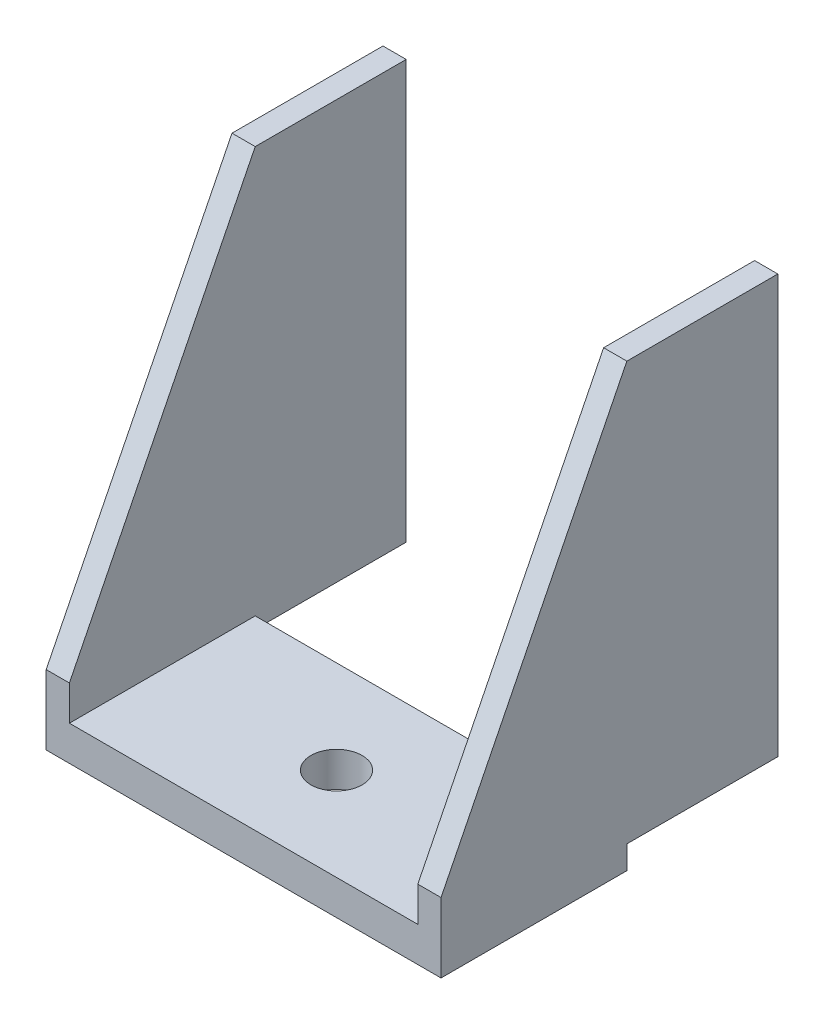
from build123d import *

# Parameters (mm, degrees)
SKETCH2_W           = 150
SKETCH2_H           = 80
SKETCH2_R           = 11
BOSS_EXTRUDE1_DEPTH = 15
BOSS_EXTRUDE2_DEPTH = 10


with BuildPart() as part:
    # Sketch2 → Boss-Extrude1 (new body)
    with BuildSketch(Plane(origin=(0, 0, 0), x_dir=(1, 0, 0), z_dir=(0, 1, 0))):
        Rectangle(SKETCH2_W, SKETCH2_H)
        with Locations(Location((0, 0, 0), (0, 0, 270))):
            Circle(SKETCH2_R, mode=Mode.SUBTRACT)
    extrude(amount=BOSS_EXTRUDE1_DEPTH)

    # Sketch3 → Boss-Extrude2 (add)
    with BuildSketch(Plane(origin=(75, 0, 0), x_dir=(0, 0, -1), z_dir=(1, 0, 0))):
        Polygon((40, 0), (40, 10), (105, 10), (105, 190), (40, 190), (-40, 30), (-40, 0), align=None)
    boss_extrude2 = extrude(amount=BOSS_EXTRUDE2_DEPTH)

    # Mirror1: Boss-Extrude2 across plane
    add(boss_extrude2.mirror(Plane(origin=(0, 0, 0), x_dir=(0, 0, 1), z_dir=(1, 0, 0))))


solid = part.part
